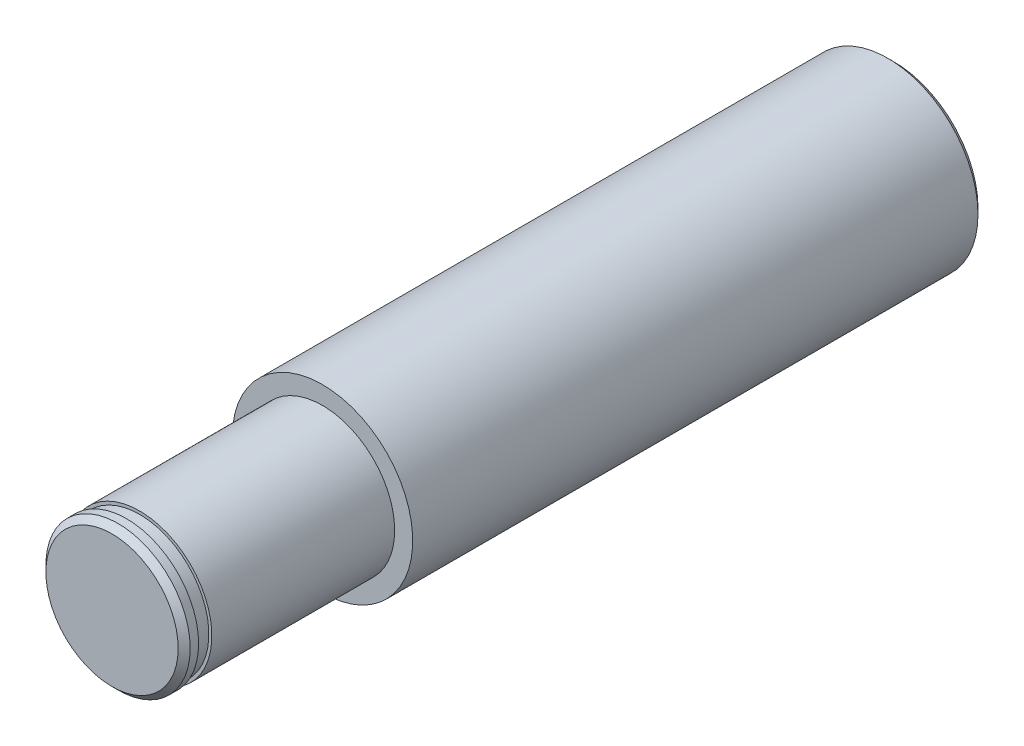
from build123d import *

# Parameters (mm, degrees)
ESQUISSE1_R      = 7.5
EXTRUSION1_DEPTH = 65
CHANFREIN1_SIZE  = 0.5
ESQUISSE3_W      = 17.5
ESQUISSE3_H      = 5.714699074
ESQUISSE2_W      = 1.1
ESQUISSE2_H      = 4.25
CHANFREIN2_SIZE  = 0.5


with BuildPart() as part:
    # Esquisse1 → Extrusion1 (new body)
    with BuildSketch(Plane.XY):
        with Locations(Location((0, 0, 0), (0, 0, 180))):
            Circle(ESQUISSE1_R)
    extrude(amount=EXTRUSION1_DEPTH)

    # Chanfrein1
    chanfrein1_edges = [part.edges().sort_by_distance(p)[0] for p in [
        (7.5, 0, 0),
    ]]
    chamfer(chanfrein1_edges, length=CHANFREIN1_SIZE)

    # Esquisse3 → Enl_vement de mati_re-R_volution2 (revolve, cut)
    with BuildSketch(Plane(origin=(0, 0, 0), x_dir=(0, 0, -1), z_dir=(1, 0, 0)), mode=Mode.PRIVATE) as enl_vement_de_mati_re_r_volution2_sk:
        with Locations((-56.25, 8.857349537)):
            Rectangle(ESQUISSE3_W, ESQUISSE3_H)
    revolve(enl_vement_de_mati_re_r_volution2_sk.sketch.rotate(Axis((0, 0, 0), (0, 0, 1)), 90), axis=Axis((0, 0, 0), (0, 0, 1)), mode=Mode.SUBTRACT)

    # Esquisse2 → Enl_vement de mati_re-R_volution1 (revolve, cut)
    with BuildSketch(Plane(origin=(0, 0, 0), x_dir=(0, 0, -1), z_dir=(1, 0, 0)), mode=Mode.PRIVATE) as enl_vement_de_mati_re_r_volution1_sk:
        with Locations((-63.25, 7.875)):
            Rectangle(ESQUISSE2_W, ESQUISSE2_H)
    revolve(enl_vement_de_mati_re_r_volution1_sk.sketch.rotate(Axis((0, 0, 0), (0, 0, 1)), 270), axis=Axis((0, 0, 0), (0, 0, 1)), mode=Mode.SUBTRACT)

    # Chanfrein2
    chanfrein2_edges = [part.edges().sort_by_distance(p)[0] for p in [
        (6, 0, 65),
    ]]
    chamfer(chanfrein2_edges, length=CHANFREIN2_SIZE)


solid = part.part
